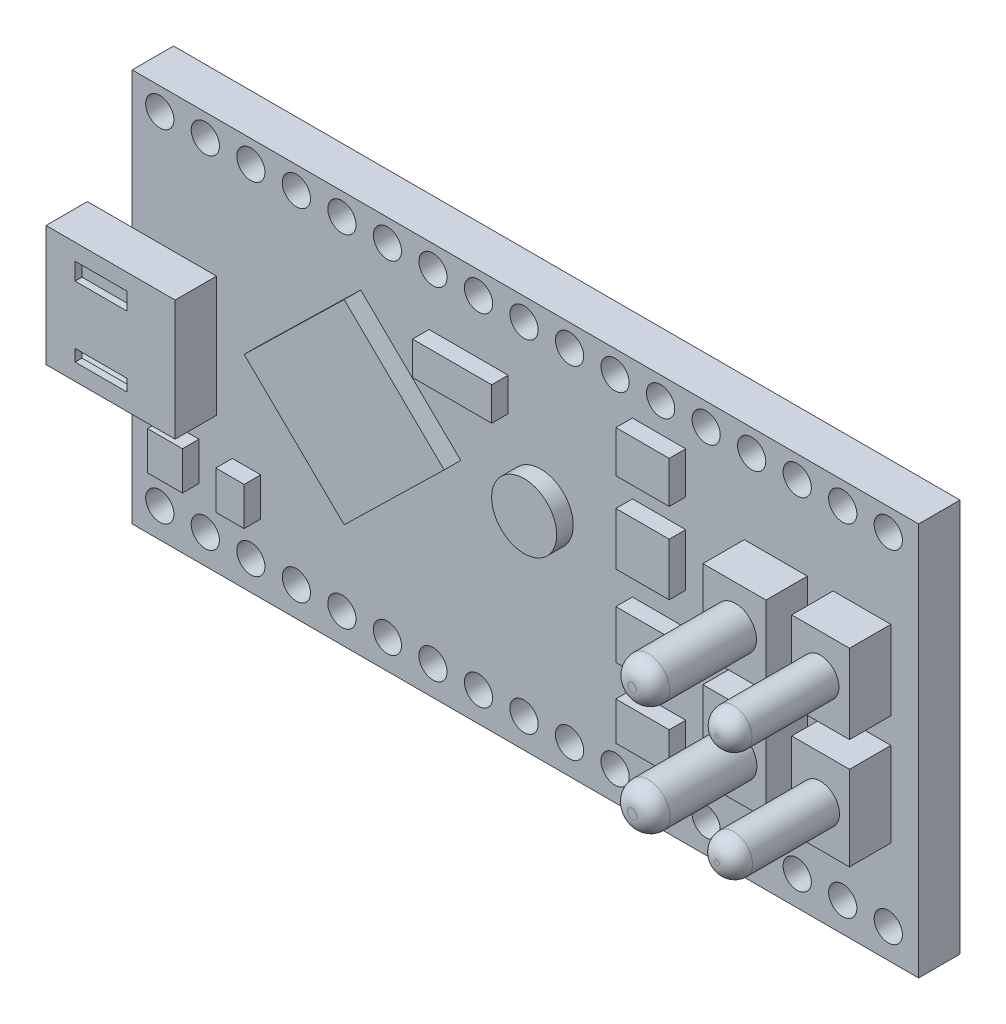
from build123d import *

# Parameters (mm, degrees)
SKETCH_1_W          = 3.8
SKETCH_1_H          = 1.9
EXTRUDE_1_DEPTH     = 0.2
SKETCH_2_W          = 0.62389251
SKETCH_2_H          = 0.582299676
EXTRUDE_2_DEPTH     = 0.2
SKETCH_3_W          = 0.250167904
SKETCH_3_H          = 0.083389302
SKETCH_3_H_2        = 0.057330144
CUT_EXTRUDE_1_DEPTH = 0.1
SKETCH_4_W          = 0.116256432
SKETCH_4_H          = 0.47665137
CUT_EXTRUDE_2_DEPTH = 0.5
SKETCH_5_R          = 0.157054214
SKETCH_5_W          = 0.382567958
SKETCH_5_H          = 0.161081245
SKETCH_5_W_2        = 0.169135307
SKETCH_5_H_2        = 0.185243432
SKETCH_5_W_3        = 0.136919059
SKETCH_5_W_4        = 0.257729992
SKETCH_5_H_3        = 0.201351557
SKETCH_5_H_4        = 0.253702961
SKETCH_5_H_5        = 0.233567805
EXTRUDE_3_DEPTH     = 0.08
SKETCH_6_R          = 0.068174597
CUT_EXTRUDE_3_DEPTH = 0.2
SKETCH_8_W          = 0.305042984
SKETCH_8_H          = 0.382596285
SKETCH_8_W_2        = 0.279191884
SKETCH_8_H_2        = 0.408447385
EXTRUDE_4_DEPTH     = 0.2
SKETCH_9_R          = 0.100790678
SKETCH_9_R_2        = 0.089309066
SKETCH_9_R_3        = 0.091837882
SKETCH_9_R_4        = 0.103038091
EXTRUDE_5_DEPTH     = 0.5
FILLET_3_R          = 0.08


with BuildPart() as part:
    # Sketch 1 → Extrude 1 (new body)
    with BuildSketch(Plane.XY):
        with Locations((-56.35787234, -22.036099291)):
            Rectangle(SKETCH_1_W, SKETCH_1_H)
    extrude(amount=EXTRUDE_1_DEPTH)

    # Sketch 2 → Extrude 2 (add)
    with BuildSketch(Plane.XY.offset(0.2)):
        with Locations((-58.162217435, -22.036457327)):
            Rectangle(SKETCH_2_W, SKETCH_2_H)
    extrude(amount=EXTRUDE_2_DEPTH)

    # Sketch 3 → Cut-Extrude 1 (cut)
    with BuildSketch(Plane.XY.offset(0.4)):
        with Locations((-58.208433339, -21.866165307)):
            Rectangle(SKETCH_3_W, SKETCH_3_H)
        with Locations((-58.208433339, -22.217963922)):
            Rectangle(SKETCH_3_W, SKETCH_3_H_2)
    extrude(amount=-CUT_EXTRUDE_1_DEPTH, mode=Mode.SUBTRACT)

    # Sketch 4 → Cut-Extrude 2 (cut)
    with BuildSketch(Plane.ZY.offset(58.47416369)):
        with Locations((0.308506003, -22.041912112)):
            Rectangle(SKETCH_4_W, SKETCH_4_H)
    extrude(amount=-CUT_EXTRUDE_2_DEPTH, mode=Mode.SUBTRACT)

    # Sketch 5 → Extrude 3 (add)
    with BuildSketch(Plane.XY.offset(0.2)):
        with Locations((-56.283723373, -21.926248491)):
            Circle(SKETCH_5_R)
        Polygon((-57.153562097, -21.455085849), (-57.636805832, -21.926248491), (-57.153562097, -22.397411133), (-56.670318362, -21.926248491), align=None)
        with Locations((-56.632061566, -21.535626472)):
            Rectangle(SKETCH_5_W, SKETCH_5_H)
        with Locations((-58.01937379, -22.562519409)):
            Rectangle(SKETCH_5_W_2, SKETCH_5_H_2)
        with Locations((-57.705265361, -22.562519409)):
            Rectangle(SKETCH_5_W_3, SKETCH_5_H_2)
        with Locations((-55.711884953, -21.434950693)):
            Rectangle(SKETCH_5_W_4, SKETCH_5_H_3)
        with Locations((-55.711884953, -21.799397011)):
            Rectangle(SKETCH_5_W_4, SKETCH_5_H_4)
        with Locations((-55.711884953, -22.200086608)):
            Rectangle(SKETCH_5_W_4, SKETCH_5_H_5)
        with Locations((-55.711884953, -22.562519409)):
            Rectangle(SKETCH_5_W_4, SKETCH_5_H_2)
    extrude(amount=EXTRUDE_3_DEPTH)

    # Sketch 6 → Cut-Extrude 3 (cut)
    with BuildSketch(Plane.XY.offset(0.2)):
        with Locations((-58.124439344, -21.194228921)):
            Circle(SKETCH_6_R)
        with Locations((-57.904439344, -21.194228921)):
            Circle(SKETCH_6_R)
        with Locations((-57.684439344, -21.194228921)):
            Circle(SKETCH_6_R)
        with Locations((-57.464439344, -21.194228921)):
            Circle(SKETCH_6_R)
        with Locations((-57.244439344, -21.194228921)):
            Circle(SKETCH_6_R)
        with Locations((-57.024439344, -21.194228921)):
            Circle(SKETCH_6_R)
        with Locations((-56.804439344, -21.194228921)):
            Circle(SKETCH_6_R)
        with Locations((-56.584439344, -21.194228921)):
            Circle(SKETCH_6_R)
        with Locations((-56.364439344, -21.194228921)):
            Circle(SKETCH_6_R)
        with Locations((-56.144439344, -21.194228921)):
            Circle(SKETCH_6_R)
        with Locations((-55.924439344, -21.194228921)):
            Circle(SKETCH_6_R)
        with Locations((-55.704439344, -21.194228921)):
            Circle(SKETCH_6_R)
        with Locations((-55.484439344, -21.194228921)):
            Circle(SKETCH_6_R)
        with Locations((-55.264439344, -21.194228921)):
            Circle(SKETCH_6_R)
        with Locations((-55.044439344, -21.194228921)):
            Circle(SKETCH_6_R)
        with Locations((-54.824439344, -21.194228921)):
            Circle(SKETCH_6_R)
        with Locations((-54.604439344, -21.194228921)):
            Circle(SKETCH_6_R)
        with Locations((-57.904439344, -22.844228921)):
            Circle(SKETCH_6_R)
        with Locations((-57.684439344, -22.844228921)):
            Circle(SKETCH_6_R)
        with Locations((-57.464439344, -22.844228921)):
            Circle(SKETCH_6_R)
        with Locations((-57.244439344, -22.844228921)):
            Circle(SKETCH_6_R)
        with Locations((-57.024439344, -22.844228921)):
            Circle(SKETCH_6_R)
        with Locations((-56.804439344, -22.844228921)):
            Circle(SKETCH_6_R)
        with Locations((-56.584439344, -22.844228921)):
            Circle(SKETCH_6_R)
        with Locations((-56.364439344, -22.844228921)):
            Circle(SKETCH_6_R)
        with Locations((-56.144439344, -22.844228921)):
            Circle(SKETCH_6_R)
        with Locations((-55.924439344, -22.844228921)):
            Circle(SKETCH_6_R)
        with Locations((-55.704439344, -22.844228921)):
            Circle(SKETCH_6_R)
        with Locations((-55.484439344, -22.844228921)):
            Circle(SKETCH_6_R)
        with Locations((-55.264439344, -22.844228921)):
            Circle(SKETCH_6_R)
        with Locations((-55.044439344, -22.844228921)):
            Circle(SKETCH_6_R)
        with Locations((-54.824439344, -22.844228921)):
            Circle(SKETCH_6_R)
        with Locations((-54.604439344, -22.844228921)):
            Circle(SKETCH_6_R)
        with Locations((-58.124439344, -22.844228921)):
            Circle(SKETCH_6_R)
    extrude(amount=-CUT_EXTRUDE_3_DEPTH, mode=Mode.SUBTRACT)

    # Sketch 8 → Extrude 4 (add)
    with BuildSketch(Plane.XY.offset(0.2)):
        with Locations((-55.147626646, -21.764419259)):
            Rectangle(SKETCH_8_W, SKETCH_8_H)
        with Locations((-54.73142393, -21.764419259)):
            Rectangle(SKETCH_8_W_2, SKETCH_8_H)
        with Locations((-55.147626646, -22.284026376)):
            Rectangle(SKETCH_8_W, SKETCH_8_H_2)
        with Locations((-54.73142393, -22.284026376)):
            Rectangle(SKETCH_8_W_2, SKETCH_8_H_2)
    extrude(amount=EXTRUDE_4_DEPTH)

    # Sketch 9 → Extrude 5 (add)
    with BuildSketch(Plane.XY.offset(0.4)):
        with Locations((-55.142294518, -21.761973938)):
            Circle(SKETCH_9_R)
        with Locations((-54.732206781, -21.761973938)):
            Circle(SKETCH_9_R_2)
        with Locations((-54.732206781, -22.291454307)):
            Circle(SKETCH_9_R_3)
        with Locations((-55.142294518, -22.291454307)):
            Circle(SKETCH_9_R_4)
    extrude(amount=EXTRUDE_5_DEPTH)

    # Fillet 3
    fillet_3_edges = [part.edges().sort_by_distance(p)[0] for p in [
        (-55.243085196, -21.761973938, 0.9),
        (-54.821515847, -21.761973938, 0.9),
        (-54.824044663, -22.291454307, 0.9),
        (-55.245332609, -22.291454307, 0.9),
    ]]
    fillet(fillet_3_edges, radius=FILLET_3_R)


solid = part.part
